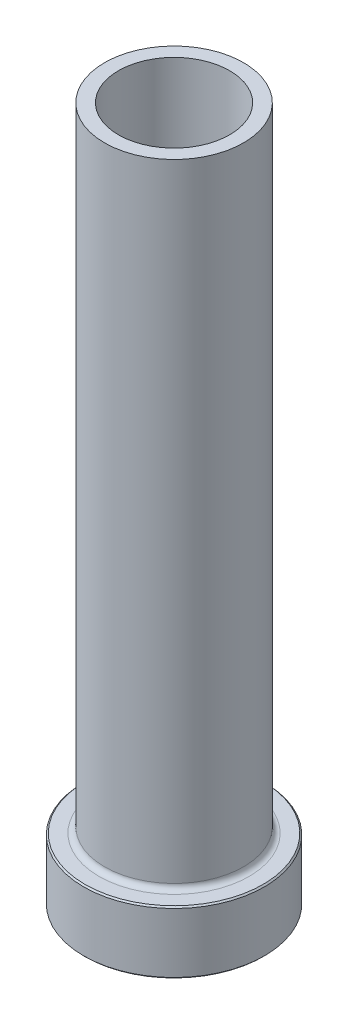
from build123d import *

# Parameters (mm, degrees)
FILLET1_R     = 0.8
CHAMFER1_SIZE = 0.2
CHAMFER3_SIZE = 0.5


with BuildPart() as part:
    # Sketch1 → Revolve1 (revolve)
    with BuildSketch(Plane.XY, mode=Mode.PRIVATE) as revolve1_sk:
        Polygon((-8, 100), (-10, 100), (-10, 9), (-13, 9), (-13, 0), (-8.25, 0), (-8.25, 33), (-8, 45), align=None)
    revolve(revolve1_sk.sketch.rotate(Axis((0, 92.187680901, 0), (0, -1, 0)), 270), axis=Axis((0, 92.187680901, 0), (0, -1, 0)))

    # Fillet1
    fillet1_edges = [part.edges().sort_by_distance(p)[0] for p in [
        (0, 9, -10),
    ]]
    fillet(fillet1_edges, radius=FILLET1_R)

    # Chamfer1
    chamfer1_edges = [part.edges().sort_by_distance(p)[0] for p in [
        (0, 0, -13),
        (0, 9, -13),
    ]]
    chamfer(chamfer1_edges, length=CHAMFER1_SIZE)

    # Chamfer3
    chamfer3_edges = [part.edges().sort_by_distance(p)[0] for p in [
        (0, 0, -8.25),
    ]]
    chamfer(chamfer3_edges, length=CHAMFER3_SIZE)


solid = part.part
